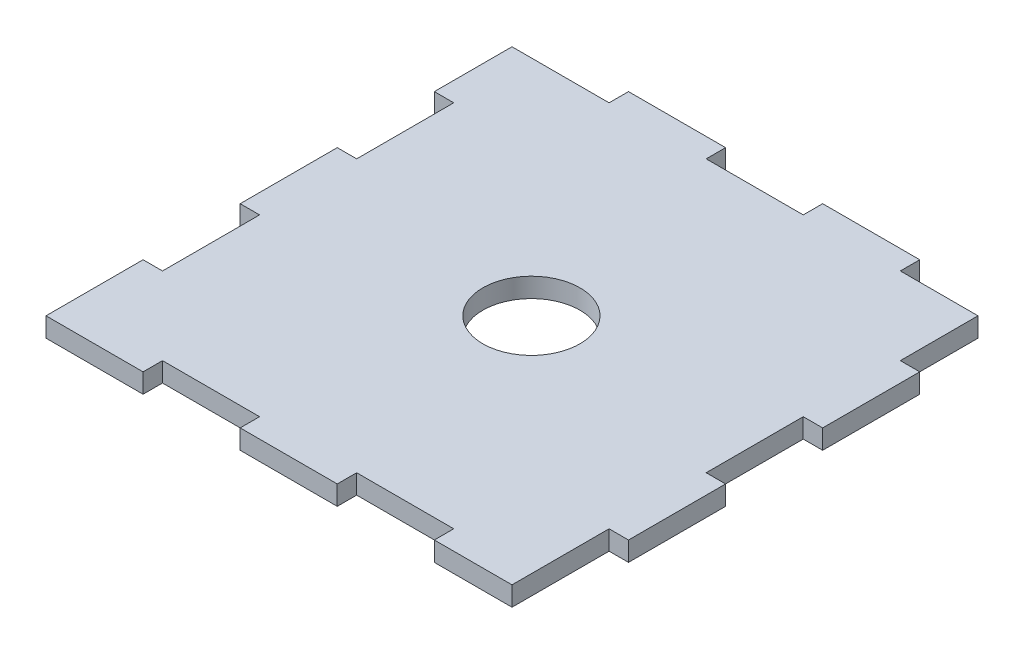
ISO-10303-21;
HEADER;
FILE_DESCRIPTION(('STEP AP214'),'2;1');
FILE_NAME('part.step','',(''),(''),'','','');
FILE_SCHEMA(('AUTOMOTIVE_DESIGN { 1 0 10303 214 1 1 1 1 }'));
ENDSEC;
DATA;
#1=APPLICATION_CONTEXT('core data for automotive mechanical design processes');
#2=APPLICATION_PROTOCOL_DEFINITION('international standard','automotive_design',2000,#1);
#3=PRODUCT_CONTEXT('',#1,'mechanical');
#4=PRODUCT('Part','Part','',(#3));
#5=PRODUCT_RELATED_PRODUCT_CATEGORY('part','',(#4));
#6=PRODUCT_DEFINITION_FORMATION('','',#4);
#7=PRODUCT_DEFINITION_CONTEXT('part definition',#1,'design');
#8=PRODUCT_DEFINITION('design','',#6,#7);
#9=PRODUCT_DEFINITION_SHAPE('','',#8);
#10=(LENGTH_UNIT() NAMED_UNIT(*) SI_UNIT(.MILLI.,.METRE.));
#11=(NAMED_UNIT(*) PLANE_ANGLE_UNIT() SI_UNIT($,.RADIAN.));
#12=(NAMED_UNIT(*) SI_UNIT($,.STERADIAN.) SOLID_ANGLE_UNIT());
#13=UNCERTAINTY_MEASURE_WITH_UNIT(LENGTH_MEASURE(1.E-05),#10,'distance_accuracy_value','');
#14=(GEOMETRIC_REPRESENTATION_CONTEXT(3) GLOBAL_UNCERTAINTY_ASSIGNED_CONTEXT((#13)) GLOBAL_UNIT_ASSIGNED_CONTEXT((#10,
#11,#12)) REPRESENTATION_CONTEXT('',''));
#15=CARTESIAN_POINT('',(0.,0.,0.));
#16=DIRECTION('',(0.,0.,1.));
#17=DIRECTION('',(1.,0.,0.));
#18=AXIS2_PLACEMENT_3D('',#15,#16,#17);
#19=CARTESIAN_POINT('',(0.,4.,0.));
#20=DIRECTION('',(0.,1.,0.));
#21=DIRECTION('',(0.,0.,1.));
#22=AXIS2_PLACEMENT_3D('',#19,#20,#21);
#23=PLANE('',#22);
#24=DIRECTION('',(0.,0.,-1.));
#25=VECTOR('',#24,1.);
#26=CARTESIAN_POINT('',(46.,4.,30.));
#27=LINE('',#26,#25);
#28=CARTESIAN_POINT('',(46.,4.,50.));
#29=VERTEX_POINT('',#28);
#30=CARTESIAN_POINT('',(46.,4.,30.));
#31=VERTEX_POINT('',#30);
#32=EDGE_CURVE('E369',#29,#31,#27,.T.);
#33=ORIENTED_EDGE('',*,*,#32,.T.);
#34=DIRECTION('',(1.,0.,0.));
#35=VECTOR('',#34,1.);
#36=CARTESIAN_POINT('',(50.,4.,30.));
#37=LINE('',#36,#35);
#38=CARTESIAN_POINT('',(50.,4.,30.));
#39=VERTEX_POINT('',#38);
#40=EDGE_CURVE('E177',#31,#39,#37,.T.);
#41=ORIENTED_EDGE('',*,*,#40,.T.);
#42=DIRECTION('',(0.,0.,-1.));
#43=VECTOR('',#42,1.);
#44=CARTESIAN_POINT('',(50.,4.,9.99999999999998));
#45=LINE('',#44,#43);
#46=CARTESIAN_POINT('',(50.,4.,9.99999999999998));
#47=VERTEX_POINT('',#46);
#48=EDGE_CURVE('E468',#39,#47,#45,.T.);
#49=ORIENTED_EDGE('',*,*,#48,.T.);
#50=DIRECTION('',(-1.,0.,0.));
#51=VECTOR('',#50,1.);
#52=CARTESIAN_POINT('',(46.,4.,9.99999999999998));
#53=LINE('',#52,#51);
#54=CARTESIAN_POINT('',(46.,4.,9.99999999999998));
#55=VERTEX_POINT('',#54);
#56=EDGE_CURVE('E487',#47,#55,#53,.T.);
#57=ORIENTED_EDGE('',*,*,#56,.T.);
#58=DIRECTION('',(0.,0.,-1.));
#59=VECTOR('',#58,1.);
#60=CARTESIAN_POINT('',(46.,4.,-10.));
#61=LINE('',#60,#59);
#62=CARTESIAN_POINT('',(46.,4.,-10.));
#63=VERTEX_POINT('',#62);
#64=EDGE_CURVE('E484',#55,#63,#61,.T.);
#65=ORIENTED_EDGE('',*,*,#64,.T.);
#66=DIRECTION('',(1.,0.,0.));
#67=VECTOR('',#66,1.);
#68=CARTESIAN_POINT('',(50.,4.,-10.));
#69=LINE('',#68,#67);
#70=CARTESIAN_POINT('',(50.,4.,-10.));
#71=VERTEX_POINT('',#70);
#72=EDGE_CURVE('E486',#63,#71,#69,.T.);
#73=ORIENTED_EDGE('',*,*,#72,.T.);
#74=DIRECTION('',(0.,0.,-1.));
#75=VECTOR('',#74,1.);
#76=CARTESIAN_POINT('',(50.,4.,-30.));
#77=LINE('',#76,#75);
#78=CARTESIAN_POINT('',(50.,4.,-30.));
#79=VERTEX_POINT('',#78);
#80=EDGE_CURVE('E489',#71,#79,#77,.T.);
#81=ORIENTED_EDGE('',*,*,#80,.T.);
#82=DIRECTION('',(-1.,0.,0.));
#83=VECTOR('',#82,1.);
#84=CARTESIAN_POINT('',(46.,4.,-30.));
#85=LINE('',#84,#83);
#86=CARTESIAN_POINT('',(46.,4.,-30.));
#87=VERTEX_POINT('',#86);
#88=EDGE_CURVE('E495',#79,#87,#85,.T.);
#89=ORIENTED_EDGE('',*,*,#88,.T.);
#90=DIRECTION('',(0.,0.,-1.));
#91=VECTOR('',#90,1.);
#92=CARTESIAN_POINT('',(46.,4.,-46.));
#93=LINE('',#92,#91);
#94=CARTESIAN_POINT('',(46.,4.,-46.));
#95=VERTEX_POINT('',#94);
#96=EDGE_CURVE('E497',#87,#95,#93,.T.);
#97=ORIENTED_EDGE('',*,*,#96,.T.);
#98=DIRECTION('',(-1.,0.,0.));
#99=VECTOR('',#98,1.);
#100=CARTESIAN_POINT('',(30.,4.,-46.));
#101=LINE('',#100,#99);
#102=CARTESIAN_POINT('',(30.,4.,-46.));
#103=VERTEX_POINT('',#102);
#104=EDGE_CURVE('E499',#95,#103,#101,.T.);
#105=ORIENTED_EDGE('',*,*,#104,.T.);
#106=DIRECTION('',(0.,0.,-1.));
#107=VECTOR('',#106,1.);
#108=CARTESIAN_POINT('',(30.,4.,-50.));
#109=LINE('',#108,#107);
#110=CARTESIAN_POINT('',(30.,4.,-50.));
#111=VERTEX_POINT('',#110);
#112=EDGE_CURVE('E501',#103,#111,#109,.T.);
#113=ORIENTED_EDGE('',*,*,#112,.T.);
#114=DIRECTION('',(-1.,0.,0.));
#115=VECTOR('',#114,1.);
#116=CARTESIAN_POINT('',(9.99999999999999,4.,-50.));
#117=LINE('',#116,#115);
#118=CARTESIAN_POINT('',(9.99999999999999,4.,-50.));
#119=VERTEX_POINT('',#118);
#120=EDGE_CURVE('E503',#111,#119,#117,.T.);
#121=ORIENTED_EDGE('',*,*,#120,.T.);
#122=DIRECTION('',(0.,0.,1.));
#123=VECTOR('',#122,1.);
#124=CARTESIAN_POINT('',(9.99999999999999,4.,-46.0000000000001));
#125=LINE('',#124,#123);
#126=CARTESIAN_POINT('',(9.99999999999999,4.,-46.0000000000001));
#127=VERTEX_POINT('',#126);
#128=EDGE_CURVE('E505',#119,#127,#125,.T.);
#129=ORIENTED_EDGE('',*,*,#128,.T.);
#130=DIRECTION('',(-1.,0.,0.));
#131=VECTOR('',#130,1.);
#132=CARTESIAN_POINT('',(-10.,4.,-46.0000000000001));
#133=LINE('',#132,#131);
#134=CARTESIAN_POINT('',(-10.,4.,-46.0000000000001));
#135=VERTEX_POINT('',#134);
#136=EDGE_CURVE('E507',#127,#135,#133,.T.);
#137=ORIENTED_EDGE('',*,*,#136,.T.);
#138=DIRECTION('',(0.,0.,-1.));
#139=VECTOR('',#138,1.);
#140=CARTESIAN_POINT('',(-10.,4.,-50.));
#141=LINE('',#140,#139);
#142=CARTESIAN_POINT('',(-10.,4.,-50.));
#143=VERTEX_POINT('',#142);
#144=EDGE_CURVE('E509',#135,#143,#141,.T.);
#145=ORIENTED_EDGE('',*,*,#144,.T.);
#146=DIRECTION('',(-1.,0.,0.));
#147=VECTOR('',#146,1.);
#148=CARTESIAN_POINT('',(-30.,4.,-50.));
#149=LINE('',#148,#147);
#150=CARTESIAN_POINT('',(-30.,4.,-50.));
#151=VERTEX_POINT('',#150);
#152=EDGE_CURVE('E511',#143,#151,#149,.T.);
#153=ORIENTED_EDGE('',*,*,#152,.T.);
#154=DIRECTION('',(0.,0.,1.));
#155=VECTOR('',#154,1.);
#156=CARTESIAN_POINT('',(-30.,4.,-46.));
#157=LINE('',#156,#155);
#158=CARTESIAN_POINT('',(-30.,4.,-46.));
#159=VERTEX_POINT('',#158);
#160=EDGE_CURVE('E513',#151,#159,#157,.T.);
#161=ORIENTED_EDGE('',*,*,#160,.T.);
#162=DIRECTION('',(-1.,0.,0.));
#163=VECTOR('',#162,1.);
#164=CARTESIAN_POINT('',(-50.,4.,-46.));
#165=LINE('',#164,#163);
#166=CARTESIAN_POINT('',(-50.,4.,-46.));
#167=VERTEX_POINT('',#166);
#168=EDGE_CURVE('E515',#159,#167,#165,.T.);
#169=ORIENTED_EDGE('',*,*,#168,.T.);
#170=DIRECTION('',(0.,0.,1.));
#171=VECTOR('',#170,1.);
#172=CARTESIAN_POINT('',(-50.,4.,-46.));
#173=LINE('',#172,#171);
#174=CARTESIAN_POINT('',(-50.,4.,-30.));
#175=VERTEX_POINT('',#174);
#176=EDGE_CURVE('E517',#167,#175,#173,.T.);
#177=ORIENTED_EDGE('',*,*,#176,.T.);
#178=DIRECTION('',(1.,0.,0.));
#179=VECTOR('',#178,1.);
#180=CARTESIAN_POINT('',(-50.,4.,-30.));
#181=LINE('',#180,#179);
#182=CARTESIAN_POINT('',(-46.,4.,-30.));
#183=VERTEX_POINT('',#182);
#184=EDGE_CURVE('E519',#175,#183,#181,.T.);
#185=ORIENTED_EDGE('',*,*,#184,.T.);
#186=DIRECTION('',(0.,0.,1.));
#187=VECTOR('',#186,1.);
#188=CARTESIAN_POINT('',(-46.,4.,-30.));
#189=LINE('',#188,#187);
#190=CARTESIAN_POINT('',(-46.,4.,-10.));
#191=VERTEX_POINT('',#190);
#192=EDGE_CURVE('E521',#183,#191,#189,.T.);
#193=ORIENTED_EDGE('',*,*,#192,.T.);
#194=DIRECTION('',(-1.,0.,0.));
#195=VECTOR('',#194,1.);
#196=CARTESIAN_POINT('',(-46.,4.,-10.));
#197=LINE('',#196,#195);
#198=CARTESIAN_POINT('',(-50.,4.,-10.));
#199=VERTEX_POINT('',#198);
#200=EDGE_CURVE('E523',#191,#199,#197,.T.);
#201=ORIENTED_EDGE('',*,*,#200,.T.);
#202=DIRECTION('',(0.,0.,1.));
#203=VECTOR('',#202,1.);
#204=CARTESIAN_POINT('',(-50.,4.,-10.));
#205=LINE('',#204,#203);
#206=CARTESIAN_POINT('',(-50.,4.,9.99999999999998));
#207=VERTEX_POINT('',#206);
#208=EDGE_CURVE('E525',#199,#207,#205,.T.);
#209=ORIENTED_EDGE('',*,*,#208,.T.);
#210=DIRECTION('',(1.,0.,0.));
#211=VECTOR('',#210,1.);
#212=CARTESIAN_POINT('',(-50.,4.,9.99999999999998));
#213=LINE('',#212,#211);
#214=CARTESIAN_POINT('',(-46.,4.,9.99999999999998));
#215=VERTEX_POINT('',#214);
#216=EDGE_CURVE('E527',#207,#215,#213,.T.);
#217=ORIENTED_EDGE('',*,*,#216,.T.);
#218=DIRECTION('',(0.,0.,1.));
#219=VECTOR('',#218,1.);
#220=CARTESIAN_POINT('',(-46.,4.,9.99999999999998));
#221=LINE('',#220,#219);
#222=CARTESIAN_POINT('',(-46.,4.,30.));
#223=VERTEX_POINT('',#222);
#224=EDGE_CURVE('E529',#215,#223,#221,.T.);
#225=ORIENTED_EDGE('',*,*,#224,.T.);
#226=DIRECTION('',(-1.,0.,0.));
#227=VECTOR('',#226,1.);
#228=CARTESIAN_POINT('',(-46.,4.,30.));
#229=LINE('',#228,#227);
#230=CARTESIAN_POINT('',(-50.,4.,30.));
#231=VERTEX_POINT('',#230);
#232=EDGE_CURVE('E531',#223,#231,#229,.T.);
#233=ORIENTED_EDGE('',*,*,#232,.T.);
#234=DIRECTION('',(0.,0.,1.));
#235=VECTOR('',#234,1.);
#236=CARTESIAN_POINT('',(-50.,4.,30.));
#237=LINE('',#236,#235);
#238=CARTESIAN_POINT('',(-50.,4.,50.));
#239=VERTEX_POINT('',#238);
#240=EDGE_CURVE('E533',#231,#239,#237,.T.);
#241=ORIENTED_EDGE('',*,*,#240,.T.);
#242=DIRECTION('',(1.,0.,0.));
#243=VECTOR('',#242,1.);
#244=CARTESIAN_POINT('',(-50.,4.,50.));
#245=LINE('',#244,#243);
#246=CARTESIAN_POINT('',(-30.,4.,50.));
#247=VERTEX_POINT('',#246);
#248=EDGE_CURVE('E535',#239,#247,#245,.T.);
#249=ORIENTED_EDGE('',*,*,#248,.T.);
#250=DIRECTION('',(0.,0.,-1.));
#251=VECTOR('',#250,1.);
#252=CARTESIAN_POINT('',(-30.,4.,46.));
#253=LINE('',#252,#251);
#254=CARTESIAN_POINT('',(-30.,4.,46.));
#255=VERTEX_POINT('',#254);
#256=EDGE_CURVE('E537',#247,#255,#253,.T.);
#257=ORIENTED_EDGE('',*,*,#256,.T.);
#258=DIRECTION('',(1.,0.,0.));
#259=VECTOR('',#258,1.);
#260=CARTESIAN_POINT('',(-10.,4.,46.));
#261=LINE('',#260,#259);
#262=CARTESIAN_POINT('',(-10.,4.,46.));
#263=VERTEX_POINT('',#262);
#264=EDGE_CURVE('E539',#255,#263,#261,.T.);
#265=ORIENTED_EDGE('',*,*,#264,.T.);
#266=DIRECTION('',(0.,0.,1.));
#267=VECTOR('',#266,1.);
#268=CARTESIAN_POINT('',(-10.,4.,46.));
#269=LINE('',#268,#267);
#270=CARTESIAN_POINT('',(-10.,4.,50.));
#271=VERTEX_POINT('',#270);
#272=EDGE_CURVE('E541',#263,#271,#269,.T.);
#273=ORIENTED_EDGE('',*,*,#272,.T.);
#274=DIRECTION('',(1.,0.,0.));
#275=VECTOR('',#274,1.);
#276=CARTESIAN_POINT('',(-10.,4.,50.));
#277=LINE('',#276,#275);
#278=CARTESIAN_POINT('',(9.99999999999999,4.,50.));
#279=VERTEX_POINT('',#278);
#280=EDGE_CURVE('E543',#271,#279,#277,.T.);
#281=ORIENTED_EDGE('',*,*,#280,.T.);
#282=DIRECTION('',(0.,0.,-1.));
#283=VECTOR('',#282,1.);
#284=CARTESIAN_POINT('',(9.99999999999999,4.,50.));
#285=LINE('',#284,#283);
#286=CARTESIAN_POINT('',(9.99999999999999,4.,46.));
#287=VERTEX_POINT('',#286);
#288=EDGE_CURVE('E280',#279,#287,#285,.T.);
#289=ORIENTED_EDGE('',*,*,#288,.T.);
#290=DIRECTION('',(1.,0.,0.));
#291=VECTOR('',#290,1.);
#292=CARTESIAN_POINT('',(9.99999999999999,4.,46.));
#293=LINE('',#292,#291);
#294=CARTESIAN_POINT('',(30.,4.,46.));
#295=VERTEX_POINT('',#294);
#296=EDGE_CURVE('E274',#287,#295,#293,.T.);
#297=ORIENTED_EDGE('',*,*,#296,.T.);
#298=DIRECTION('',(0.,0.,1.));
#299=VECTOR('',#298,1.);
#300=CARTESIAN_POINT('',(30.,4.,46.));
#301=LINE('',#300,#299);
#302=CARTESIAN_POINT('',(30.,4.,50.));
#303=VERTEX_POINT('',#302);
#304=EDGE_CURVE('E278',#295,#303,#301,.T.);
#305=ORIENTED_EDGE('',*,*,#304,.T.);
#306=DIRECTION('',(1.,0.,0.));
#307=VECTOR('',#306,1.);
#308=CARTESIAN_POINT('',(30.,4.,50.));
#309=LINE('',#308,#307);
#310=EDGE_CURVE('E50',#303,#29,#309,.T.);
#311=ORIENTED_EDGE('',*,*,#310,.T.);
#312=EDGE_LOOP('',(#33,#41,#49,#57,#65,#73,#81,#89,#97,#105,#113,#121,#129,#137,#145,#153,#161,
#169,#177,#185,#193,#201,#209,#217,#225,#233,#241,#249,#257,#265,#273,#281,#289,#297,#305,#311));
#313=FACE_BOUND('',#312,.T.);
#314=CARTESIAN_POINT('',(0.,4.,0.));
#315=DIRECTION('',(0.,1.,0.));
#316=DIRECTION('',(0.,0.,1.));
#317=AXIS2_PLACEMENT_3D('',#314,#315,#316);
#318=CIRCLE('',#317,10.);
#319=CARTESIAN_POINT('',(0.,4.,10.));
#320=VERTEX_POINT('',#319);
#321=EDGE_CURVE('E302',#320,#320,#318,.T.);
#322=ORIENTED_EDGE('',*,*,#321,.F.);
#323=EDGE_LOOP('',(#322));
#324=FACE_BOUND('',#323,.T.);
#325=ADVANCED_FACE('F33',(#313,#324),#23,.T.);
#326=CARTESIAN_POINT('',(0.,0.,0.));
#327=DIRECTION('',(0.,1.,0.));
#328=DIRECTION('',(0.,0.,1.));
#329=AXIS2_PLACEMENT_3D('',#326,#327,#328);
#330=PLANE('',#329);
#331=DIRECTION('',(0.,0.,-1.));
#332=VECTOR('',#331,1.);
#333=CARTESIAN_POINT('',(46.,0.,30.));
#334=LINE('',#333,#332);
#335=CARTESIAN_POINT('',(46.,0.,50.));
#336=VERTEX_POINT('',#335);
#337=CARTESIAN_POINT('',(46.,0.,30.));
#338=VERTEX_POINT('',#337);
#339=EDGE_CURVE('E298',#336,#338,#334,.T.);
#340=ORIENTED_EDGE('',*,*,#339,.F.);
#341=DIRECTION('',(1.,0.,0.));
#342=VECTOR('',#341,1.);
#343=CARTESIAN_POINT('',(30.,0.,50.));
#344=LINE('',#343,#342);
#345=CARTESIAN_POINT('',(30.,0.,50.));
#346=VERTEX_POINT('',#345);
#347=EDGE_CURVE('E169',#346,#336,#344,.T.);
#348=ORIENTED_EDGE('',*,*,#347,.F.);
#349=DIRECTION('',(0.,0.,1.));
#350=VECTOR('',#349,1.);
#351=CARTESIAN_POINT('',(30.,0.,46.));
#352=LINE('',#351,#350);
#353=CARTESIAN_POINT('',(30.,0.,46.));
#354=VERTEX_POINT('',#353);
#355=EDGE_CURVE('E163',#354,#346,#352,.T.);
#356=ORIENTED_EDGE('',*,*,#355,.F.);
#357=DIRECTION('',(1.,0.,0.));
#358=VECTOR('',#357,1.);
#359=CARTESIAN_POINT('',(9.99999999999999,0.,46.));
#360=LINE('',#359,#358);
#361=CARTESIAN_POINT('',(9.99999999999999,0.,46.));
#362=VERTEX_POINT('',#361);
#363=EDGE_CURVE('E288',#362,#354,#360,.T.);
#364=ORIENTED_EDGE('',*,*,#363,.F.);
#365=DIRECTION('',(0.,0.,-1.));
#366=VECTOR('',#365,1.);
#367=CARTESIAN_POINT('',(9.99999999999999,0.,50.));
#368=LINE('',#367,#366);
#369=CARTESIAN_POINT('',(9.99999999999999,0.,50.));
#370=VERTEX_POINT('',#369);
#371=EDGE_CURVE('E364',#370,#362,#368,.T.);
#372=ORIENTED_EDGE('',*,*,#371,.F.);
#373=DIRECTION('',(1.,0.,0.));
#374=VECTOR('',#373,1.);
#375=CARTESIAN_POINT('',(-10.,0.,50.));
#376=LINE('',#375,#374);
#377=CARTESIAN_POINT('',(-10.,0.,50.));
#378=VERTEX_POINT('',#377);
#379=EDGE_CURVE('E362',#378,#370,#376,.T.);
#380=ORIENTED_EDGE('',*,*,#379,.F.);
#381=DIRECTION('',(0.,0.,1.));
#382=VECTOR('',#381,1.);
#383=CARTESIAN_POINT('',(-10.,0.,46.));
#384=LINE('',#383,#382);
#385=CARTESIAN_POINT('',(-10.,0.,46.));
#386=VERTEX_POINT('',#385);
#387=EDGE_CURVE('E360',#386,#378,#384,.T.);
#388=ORIENTED_EDGE('',*,*,#387,.F.);
#389=DIRECTION('',(1.,0.,0.));
#390=VECTOR('',#389,1.);
#391=CARTESIAN_POINT('',(-10.,0.,46.));
#392=LINE('',#391,#390);
#393=CARTESIAN_POINT('',(-30.,0.,46.));
#394=VERTEX_POINT('',#393);
#395=EDGE_CURVE('E358',#394,#386,#392,.T.);
#396=ORIENTED_EDGE('',*,*,#395,.F.);
#397=DIRECTION('',(0.,0.,-1.));
#398=VECTOR('',#397,1.);
#399=CARTESIAN_POINT('',(-30.,0.,46.));
#400=LINE('',#399,#398);
#401=CARTESIAN_POINT('',(-30.,0.,50.));
#402=VERTEX_POINT('',#401);
#403=EDGE_CURVE('E356',#402,#394,#400,.T.);
#404=ORIENTED_EDGE('',*,*,#403,.F.);
#405=DIRECTION('',(1.,0.,0.));
#406=VECTOR('',#405,1.);
#407=CARTESIAN_POINT('',(-50.,0.,50.));
#408=LINE('',#407,#406);
#409=CARTESIAN_POINT('',(-50.,0.,50.));
#410=VERTEX_POINT('',#409);
#411=EDGE_CURVE('E354',#410,#402,#408,.T.);
#412=ORIENTED_EDGE('',*,*,#411,.F.);
#413=DIRECTION('',(0.,0.,1.));
#414=VECTOR('',#413,1.);
#415=CARTESIAN_POINT('',(-50.,0.,30.));
#416=LINE('',#415,#414);
#417=CARTESIAN_POINT('',(-50.,0.,30.));
#418=VERTEX_POINT('',#417);
#419=EDGE_CURVE('E352',#418,#410,#416,.T.);
#420=ORIENTED_EDGE('',*,*,#419,.F.);
#421=DIRECTION('',(-1.,0.,0.));
#422=VECTOR('',#421,1.);
#423=CARTESIAN_POINT('',(-46.,0.,30.));
#424=LINE('',#423,#422);
#425=CARTESIAN_POINT('',(-46.,0.,30.));
#426=VERTEX_POINT('',#425);
#427=EDGE_CURVE('E350',#426,#418,#424,.T.);
#428=ORIENTED_EDGE('',*,*,#427,.F.);
#429=DIRECTION('',(0.,0.,1.));
#430=VECTOR('',#429,1.);
#431=CARTESIAN_POINT('',(-46.,0.,9.99999999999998));
#432=LINE('',#431,#430);
#433=CARTESIAN_POINT('',(-46.,0.,9.99999999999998));
#434=VERTEX_POINT('',#433);
#435=EDGE_CURVE('E348',#434,#426,#432,.T.);
#436=ORIENTED_EDGE('',*,*,#435,.F.);
#437=DIRECTION('',(1.,0.,0.));
#438=VECTOR('',#437,1.);
#439=CARTESIAN_POINT('',(-50.,0.,9.99999999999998));
#440=LINE('',#439,#438);
#441=CARTESIAN_POINT('',(-50.,0.,9.99999999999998));
#442=VERTEX_POINT('',#441);
#443=EDGE_CURVE('E346',#442,#434,#440,.T.);
#444=ORIENTED_EDGE('',*,*,#443,.F.);
#445=DIRECTION('',(0.,0.,1.));
#446=VECTOR('',#445,1.);
#447=CARTESIAN_POINT('',(-50.,0.,-10.));
#448=LINE('',#447,#446);
#449=CARTESIAN_POINT('',(-50.,0.,-10.));
#450=VERTEX_POINT('',#449);
#451=EDGE_CURVE('E344',#450,#442,#448,.T.);
#452=ORIENTED_EDGE('',*,*,#451,.F.);
#453=DIRECTION('',(-1.,0.,0.));
#454=VECTOR('',#453,1.);
#455=CARTESIAN_POINT('',(-46.,0.,-10.));
#456=LINE('',#455,#454);
#457=CARTESIAN_POINT('',(-46.,0.,-10.));
#458=VERTEX_POINT('',#457);
#459=EDGE_CURVE('E342',#458,#450,#456,.T.);
#460=ORIENTED_EDGE('',*,*,#459,.F.);
#461=DIRECTION('',(0.,0.,1.));
#462=VECTOR('',#461,1.);
#463=CARTESIAN_POINT('',(-46.,0.,-30.));
#464=LINE('',#463,#462);
#465=CARTESIAN_POINT('',(-46.,0.,-30.));
#466=VERTEX_POINT('',#465);
#467=EDGE_CURVE('E340',#466,#458,#464,.T.);
#468=ORIENTED_EDGE('',*,*,#467,.F.);
#469=DIRECTION('',(1.,0.,0.));
#470=VECTOR('',#469,1.);
#471=CARTESIAN_POINT('',(-50.,0.,-30.));
#472=LINE('',#471,#470);
#473=CARTESIAN_POINT('',(-50.,0.,-30.));
#474=VERTEX_POINT('',#473);
#475=EDGE_CURVE('E338',#474,#466,#472,.T.);
#476=ORIENTED_EDGE('',*,*,#475,.F.);
#477=DIRECTION('',(0.,0.,1.));
#478=VECTOR('',#477,1.);
#479=CARTESIAN_POINT('',(-50.,0.,-46.));
#480=LINE('',#479,#478);
#481=CARTESIAN_POINT('',(-50.,0.,-46.));
#482=VERTEX_POINT('',#481);
#483=EDGE_CURVE('E336',#482,#474,#480,.T.);
#484=ORIENTED_EDGE('',*,*,#483,.F.);
#485=DIRECTION('',(-1.,0.,0.));
#486=VECTOR('',#485,1.);
#487=CARTESIAN_POINT('',(-50.,0.,-46.));
#488=LINE('',#487,#486);
#489=CARTESIAN_POINT('',(-30.,0.,-46.));
#490=VERTEX_POINT('',#489);
#491=EDGE_CURVE('E334',#490,#482,#488,.T.);
#492=ORIENTED_EDGE('',*,*,#491,.F.);
#493=DIRECTION('',(0.,0.,1.));
#494=VECTOR('',#493,1.);
#495=CARTESIAN_POINT('',(-30.,0.,-46.));
#496=LINE('',#495,#494);
#497=CARTESIAN_POINT('',(-30.,0.,-50.));
#498=VERTEX_POINT('',#497);
#499=EDGE_CURVE('E332',#498,#490,#496,.T.);
#500=ORIENTED_EDGE('',*,*,#499,.F.);
#501=DIRECTION('',(-1.,0.,0.));
#502=VECTOR('',#501,1.);
#503=CARTESIAN_POINT('',(-30.,0.,-50.));
#504=LINE('',#503,#502);
#505=CARTESIAN_POINT('',(-10.,0.,-50.));
#506=VERTEX_POINT('',#505);
#507=EDGE_CURVE('E330',#506,#498,#504,.T.);
#508=ORIENTED_EDGE('',*,*,#507,.F.);
#509=DIRECTION('',(0.,0.,-1.));
#510=VECTOR('',#509,1.);
#511=CARTESIAN_POINT('',(-10.,0.,-50.));
#512=LINE('',#511,#510);
#513=CARTESIAN_POINT('',(-10.,0.,-46.0000000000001));
#514=VERTEX_POINT('',#513);
#515=EDGE_CURVE('E328',#514,#506,#512,.T.);
#516=ORIENTED_EDGE('',*,*,#515,.F.);
#517=DIRECTION('',(-1.,0.,0.));
#518=VECTOR('',#517,1.);
#519=CARTESIAN_POINT('',(-10.,0.,-46.0000000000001));
#520=LINE('',#519,#518);
#521=CARTESIAN_POINT('',(9.99999999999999,0.,-46.0000000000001));
#522=VERTEX_POINT('',#521);
#523=EDGE_CURVE('E326',#522,#514,#520,.T.);
#524=ORIENTED_EDGE('',*,*,#523,.F.);
#525=DIRECTION('',(0.,0.,1.));
#526=VECTOR('',#525,1.);
#527=CARTESIAN_POINT('',(9.99999999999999,0.,-46.0000000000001));
#528=LINE('',#527,#526);
#529=CARTESIAN_POINT('',(9.99999999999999,0.,-50.));
#530=VERTEX_POINT('',#529);
#531=EDGE_CURVE('E324',#530,#522,#528,.T.);
#532=ORIENTED_EDGE('',*,*,#531,.F.);
#533=DIRECTION('',(-1.,0.,0.));
#534=VECTOR('',#533,1.);
#535=CARTESIAN_POINT('',(9.99999999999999,0.,-50.));
#536=LINE('',#535,#534);
#537=CARTESIAN_POINT('',(30.,0.,-50.));
#538=VERTEX_POINT('',#537);
#539=EDGE_CURVE('E322',#538,#530,#536,.T.);
#540=ORIENTED_EDGE('',*,*,#539,.F.);
#541=DIRECTION('',(0.,0.,-1.));
#542=VECTOR('',#541,1.);
#543=CARTESIAN_POINT('',(30.,0.,-50.));
#544=LINE('',#543,#542);
#545=CARTESIAN_POINT('',(30.,0.,-46.));
#546=VERTEX_POINT('',#545);
#547=EDGE_CURVE('E320',#546,#538,#544,.T.);
#548=ORIENTED_EDGE('',*,*,#547,.F.);
#549=DIRECTION('',(-1.,0.,0.));
#550=VECTOR('',#549,1.);
#551=CARTESIAN_POINT('',(30.,0.,-46.));
#552=LINE('',#551,#550);
#553=CARTESIAN_POINT('',(46.,0.,-46.));
#554=VERTEX_POINT('',#553);
#555=EDGE_CURVE('E318',#554,#546,#552,.T.);
#556=ORIENTED_EDGE('',*,*,#555,.F.);
#557=DIRECTION('',(0.,0.,-1.));
#558=VECTOR('',#557,1.);
#559=CARTESIAN_POINT('',(46.,0.,-46.));
#560=LINE('',#559,#558);
#561=CARTESIAN_POINT('',(46.,0.,-30.));
#562=VERTEX_POINT('',#561);
#563=EDGE_CURVE('E316',#562,#554,#560,.T.);
#564=ORIENTED_EDGE('',*,*,#563,.F.);
#565=DIRECTION('',(-1.,0.,0.));
#566=VECTOR('',#565,1.);
#567=CARTESIAN_POINT('',(46.,0.,-30.));
#568=LINE('',#567,#566);
#569=CARTESIAN_POINT('',(50.,0.,-30.));
#570=VERTEX_POINT('',#569);
#571=EDGE_CURVE('E314',#570,#562,#568,.T.);
#572=ORIENTED_EDGE('',*,*,#571,.F.);
#573=DIRECTION('',(0.,0.,-1.));
#574=VECTOR('',#573,1.);
#575=CARTESIAN_POINT('',(50.,0.,-30.));
#576=LINE('',#575,#574);
#577=CARTESIAN_POINT('',(50.,0.,-10.));
#578=VERTEX_POINT('',#577);
#579=EDGE_CURVE('E312',#578,#570,#576,.T.);
#580=ORIENTED_EDGE('',*,*,#579,.F.);
#581=DIRECTION('',(1.,0.,0.));
#582=VECTOR('',#581,1.);
#583=CARTESIAN_POINT('',(50.,0.,-10.));
#584=LINE('',#583,#582);
#585=CARTESIAN_POINT('',(46.,0.,-10.));
#586=VERTEX_POINT('',#585);
#587=EDGE_CURVE('E310',#586,#578,#584,.T.);
#588=ORIENTED_EDGE('',*,*,#587,.F.);
#589=DIRECTION('',(0.,0.,-1.));
#590=VECTOR('',#589,1.);
#591=CARTESIAN_POINT('',(46.,0.,-10.));
#592=LINE('',#591,#590);
#593=CARTESIAN_POINT('',(46.,0.,9.99999999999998));
#594=VERTEX_POINT('',#593);
#595=EDGE_CURVE('E308',#594,#586,#592,.T.);
#596=ORIENTED_EDGE('',*,*,#595,.F.);
#597=DIRECTION('',(-1.,0.,0.));
#598=VECTOR('',#597,1.);
#599=CARTESIAN_POINT('',(46.,0.,9.99999999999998));
#600=LINE('',#599,#598);
#601=CARTESIAN_POINT('',(50.,0.,9.99999999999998));
#602=VERTEX_POINT('',#601);
#603=EDGE_CURVE('E306',#602,#594,#600,.T.);
#604=ORIENTED_EDGE('',*,*,#603,.F.);
#605=DIRECTION('',(0.,0.,-1.));
#606=VECTOR('',#605,1.);
#607=CARTESIAN_POINT('',(50.,0.,9.99999999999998));
#608=LINE('',#607,#606);
#609=CARTESIAN_POINT('',(50.,0.,30.));
#610=VERTEX_POINT('',#609);
#611=EDGE_CURVE('E304',#610,#602,#608,.T.);
#612=ORIENTED_EDGE('',*,*,#611,.F.);
#613=DIRECTION('',(1.,0.,0.));
#614=VECTOR('',#613,1.);
#615=CARTESIAN_POINT('',(50.,0.,30.));
#616=LINE('',#615,#614);
#617=EDGE_CURVE('E301',#338,#610,#616,.T.);
#618=ORIENTED_EDGE('',*,*,#617,.F.);
#619=EDGE_LOOP('',(#340,#348,#356,#364,#372,#380,#388,#396,#404,#412,#420,#428,#436,#444,#452,
#460,#468,#476,#484,#492,#500,#508,#516,#524,#532,#540,#548,#556,#564,#572,#580,#588,#596,#604,
#612,#618));
#620=FACE_BOUND('',#619,.T.);
#621=CARTESIAN_POINT('',(0.,0.,0.));
#622=DIRECTION('',(0.,1.,0.));
#623=DIRECTION('',(0.,0.,1.));
#624=AXIS2_PLACEMENT_3D('',#621,#622,#623);
#625=CIRCLE('',#624,10.);
#626=CARTESIAN_POINT('',(0.,0.,10.));
#627=VERTEX_POINT('',#626);
#628=EDGE_CURVE('E1002',#627,#627,#625,.T.);
#629=ORIENTED_EDGE('',*,*,#628,.T.);
#630=EDGE_LOOP('',(#629));
#631=FACE_BOUND('',#630,.T.);
#632=ADVANCED_FACE('F472',(#620,#631),#330,.F.);
#633=CARTESIAN_POINT('',(46.,4.,30.));
#634=DIRECTION('',(-1.,0.,0.));
#635=DIRECTION('',(0.,0.,1.));
#636=AXIS2_PLACEMENT_3D('',#633,#634,#635);
#637=PLANE('',#636);
#638=ORIENTED_EDGE('',*,*,#339,.T.);
#639=DIRECTION('',(0.,-1.,0.));
#640=VECTOR('',#639,1.);
#641=CARTESIAN_POINT('',(46.,4.,30.));
#642=LINE('',#641,#640);
#643=EDGE_CURVE('E11',#31,#338,#642,.T.);
#644=ORIENTED_EDGE('',*,*,#643,.F.);
#645=ORIENTED_EDGE('',*,*,#32,.F.);
#646=DIRECTION('',(0.,-1.,0.));
#647=VECTOR('',#646,1.);
#648=CARTESIAN_POINT('',(46.,4.,50.));
#649=LINE('',#648,#647);
#650=EDGE_CURVE('E294',#29,#336,#649,.T.);
#651=ORIENTED_EDGE('',*,*,#650,.T.);
#652=EDGE_LOOP('',(#638,#644,#645,#651));
#653=FACE_BOUND('',#652,.T.);
#654=ADVANCED_FACE('F35',(#653),#637,.F.);
#655=CARTESIAN_POINT('',(50.,4.,30.));
#656=DIRECTION('',(0.,0.,-1.));
#657=DIRECTION('',(-1.,0.,0.));
#658=AXIS2_PLACEMENT_3D('',#655,#656,#657);
#659=PLANE('',#658);
#660=ORIENTED_EDGE('',*,*,#617,.T.);
#661=DIRECTION('',(0.,-1.,0.));
#662=VECTOR('',#661,1.);
#663=CARTESIAN_POINT('',(50.,4.,30.));
#664=LINE('',#663,#662);
#665=EDGE_CURVE('E42',#39,#610,#664,.T.);
#666=ORIENTED_EDGE('',*,*,#665,.F.);
#667=ORIENTED_EDGE('',*,*,#40,.F.);
#668=ORIENTED_EDGE('',*,*,#643,.T.);
#669=EDGE_LOOP('',(#660,#666,#667,#668));
#670=FACE_BOUND('',#669,.T.);
#671=ADVANCED_FACE('F577',(#670),#659,.F.);
#672=CARTESIAN_POINT('',(50.,4.,9.99999999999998));
#673=DIRECTION('',(-1.,0.,0.));
#674=DIRECTION('',(0.,0.,1.));
#675=AXIS2_PLACEMENT_3D('',#672,#673,#674);
#676=PLANE('',#675);
#677=ORIENTED_EDGE('',*,*,#611,.T.);
#678=DIRECTION('',(0.,-1.,0.));
#679=VECTOR('',#678,1.);
#680=CARTESIAN_POINT('',(50.,4.,9.99999999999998));
#681=LINE('',#680,#679);
#682=EDGE_CURVE('E460',#47,#602,#681,.T.);
#683=ORIENTED_EDGE('',*,*,#682,.F.);
#684=ORIENTED_EDGE('',*,*,#48,.F.);
#685=ORIENTED_EDGE('',*,*,#665,.T.);
#686=EDGE_LOOP('',(#677,#683,#684,#685));
#687=FACE_BOUND('',#686,.T.);
#688=ADVANCED_FACE('F466',(#687),#676,.F.);
#689=CARTESIAN_POINT('',(46.,4.,9.99999999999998));
#690=DIRECTION('',(0.,0.,1.));
#691=DIRECTION('',(1.,0.,0.));
#692=AXIS2_PLACEMENT_3D('',#689,#690,#691);
#693=PLANE('',#692);
#694=ORIENTED_EDGE('',*,*,#603,.T.);
#695=DIRECTION('',(0.,-1.,0.));
#696=VECTOR('',#695,1.);
#697=CARTESIAN_POINT('',(46.,4.,9.99999999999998));
#698=LINE('',#697,#696);
#699=EDGE_CURVE('E457',#55,#594,#698,.T.);
#700=ORIENTED_EDGE('',*,*,#699,.F.);
#701=ORIENTED_EDGE('',*,*,#56,.F.);
#702=ORIENTED_EDGE('',*,*,#682,.T.);
#703=EDGE_LOOP('',(#694,#700,#701,#702));
#704=FACE_BOUND('',#703,.T.);
#705=ADVANCED_FACE('F478',(#704),#693,.F.);
#706=CARTESIAN_POINT('',(46.,4.,-10.));
#707=DIRECTION('',(-1.,0.,0.));
#708=DIRECTION('',(0.,0.,1.));
#709=AXIS2_PLACEMENT_3D('',#706,#707,#708);
#710=PLANE('',#709);
#711=ORIENTED_EDGE('',*,*,#595,.T.);
#712=DIRECTION('',(0.,-1.,0.));
#713=VECTOR('',#712,1.);
#714=CARTESIAN_POINT('',(46.,4.,-10.));
#715=LINE('',#714,#713);
#716=EDGE_CURVE('E454',#63,#586,#715,.T.);
#717=ORIENTED_EDGE('',*,*,#716,.F.);
#718=ORIENTED_EDGE('',*,*,#64,.F.);
#719=ORIENTED_EDGE('',*,*,#699,.T.);
#720=EDGE_LOOP('',(#711,#717,#718,#719));
#721=FACE_BOUND('',#720,.T.);
#722=ADVANCED_FACE('F482',(#721),#710,.F.);
#723=CARTESIAN_POINT('',(50.,4.,-10.));
#724=DIRECTION('',(0.,0.,-1.));
#725=DIRECTION('',(-1.,0.,0.));
#726=AXIS2_PLACEMENT_3D('',#723,#724,#725);
#727=PLANE('',#726);
#728=ORIENTED_EDGE('',*,*,#587,.T.);
#729=DIRECTION('',(0.,-1.,0.));
#730=VECTOR('',#729,1.);
#731=CARTESIAN_POINT('',(50.,4.,-10.));
#732=LINE('',#731,#730);
#733=EDGE_CURVE('E451',#71,#578,#732,.T.);
#734=ORIENTED_EDGE('',*,*,#733,.F.);
#735=ORIENTED_EDGE('',*,*,#72,.F.);
#736=ORIENTED_EDGE('',*,*,#716,.T.);
#737=EDGE_LOOP('',(#728,#734,#735,#736));
#738=FACE_BOUND('',#737,.T.);
#739=ADVANCED_FACE('F590',(#738),#727,.F.);
#740=CARTESIAN_POINT('',(50.,4.,-30.));
#741=DIRECTION('',(-1.,0.,0.));
#742=DIRECTION('',(0.,0.,1.));
#743=AXIS2_PLACEMENT_3D('',#740,#741,#742);
#744=PLANE('',#743);
#745=ORIENTED_EDGE('',*,*,#579,.T.);
#746=DIRECTION('',(0.,-1.,0.));
#747=VECTOR('',#746,1.);
#748=CARTESIAN_POINT('',(50.,4.,-30.));
#749=LINE('',#748,#747);
#750=EDGE_CURVE('E448',#79,#570,#749,.T.);
#751=ORIENTED_EDGE('',*,*,#750,.F.);
#752=ORIENTED_EDGE('',*,*,#80,.F.);
#753=ORIENTED_EDGE('',*,*,#733,.T.);
#754=EDGE_LOOP('',(#745,#751,#752,#753));
#755=FACE_BOUND('',#754,.T.);
#756=ADVANCED_FACE('F593',(#755),#744,.F.);
#757=CARTESIAN_POINT('',(46.,4.,-30.));
#758=DIRECTION('',(0.,0.,1.));
#759=DIRECTION('',(1.,0.,0.));
#760=AXIS2_PLACEMENT_3D('',#757,#758,#759);
#761=PLANE('',#760);
#762=ORIENTED_EDGE('',*,*,#571,.T.);
#763=DIRECTION('',(0.,-1.,0.));
#764=VECTOR('',#763,1.);
#765=CARTESIAN_POINT('',(46.,4.,-30.));
#766=LINE('',#765,#764);
#767=EDGE_CURVE('E445',#87,#562,#766,.T.);
#768=ORIENTED_EDGE('',*,*,#767,.F.);
#769=ORIENTED_EDGE('',*,*,#88,.F.);
#770=ORIENTED_EDGE('',*,*,#750,.T.);
#771=EDGE_LOOP('',(#762,#768,#769,#770));
#772=FACE_BOUND('',#771,.T.);
#773=ADVANCED_FACE('F597',(#772),#761,.F.);
#774=CARTESIAN_POINT('',(46.,4.,-46.));
#775=DIRECTION('',(-1.,0.,0.));
#776=DIRECTION('',(0.,0.,1.));
#777=AXIS2_PLACEMENT_3D('',#774,#775,#776);
#778=PLANE('',#777);
#779=ORIENTED_EDGE('',*,*,#563,.T.);
#780=DIRECTION('',(0.,-1.,0.));
#781=VECTOR('',#780,1.);
#782=CARTESIAN_POINT('',(46.,4.,-46.));
#783=LINE('',#782,#781);
#784=EDGE_CURVE('E442',#95,#554,#783,.T.);
#785=ORIENTED_EDGE('',*,*,#784,.F.);
#786=ORIENTED_EDGE('',*,*,#96,.F.);
#787=ORIENTED_EDGE('',*,*,#767,.T.);
#788=EDGE_LOOP('',(#779,#785,#786,#787));
#789=FACE_BOUND('',#788,.T.);
#790=ADVANCED_FACE('F601',(#789),#778,.F.);
#791=CARTESIAN_POINT('',(30.,4.,-46.));
#792=DIRECTION('',(0.,0.,1.));
#793=DIRECTION('',(1.,0.,0.));
#794=AXIS2_PLACEMENT_3D('',#791,#792,#793);
#795=PLANE('',#794);
#796=ORIENTED_EDGE('',*,*,#555,.T.);
#797=DIRECTION('',(0.,-1.,0.));
#798=VECTOR('',#797,1.);
#799=CARTESIAN_POINT('',(30.,4.,-46.));
#800=LINE('',#799,#798);
#801=EDGE_CURVE('E439',#103,#546,#800,.T.);
#802=ORIENTED_EDGE('',*,*,#801,.F.);
#803=ORIENTED_EDGE('',*,*,#104,.F.);
#804=ORIENTED_EDGE('',*,*,#784,.T.);
#805=EDGE_LOOP('',(#796,#802,#803,#804));
#806=FACE_BOUND('',#805,.T.);
#807=ADVANCED_FACE('F605',(#806),#795,.F.);
#808=CARTESIAN_POINT('',(30.,4.,-50.));
#809=DIRECTION('',(-1.,0.,0.));
#810=DIRECTION('',(0.,0.,1.));
#811=AXIS2_PLACEMENT_3D('',#808,#809,#810);
#812=PLANE('',#811);
#813=ORIENTED_EDGE('',*,*,#547,.T.);
#814=DIRECTION('',(0.,-1.,0.));
#815=VECTOR('',#814,1.);
#816=CARTESIAN_POINT('',(30.,4.,-50.));
#817=LINE('',#816,#815);
#818=EDGE_CURVE('E436',#111,#538,#817,.T.);
#819=ORIENTED_EDGE('',*,*,#818,.F.);
#820=ORIENTED_EDGE('',*,*,#112,.F.);
#821=ORIENTED_EDGE('',*,*,#801,.T.);
#822=EDGE_LOOP('',(#813,#819,#820,#821));
#823=FACE_BOUND('',#822,.T.);
#824=ADVANCED_FACE('F609',(#823),#812,.F.);
#825=CARTESIAN_POINT('',(9.99999999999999,4.,-50.));
#826=DIRECTION('',(0.,0.,1.));
#827=DIRECTION('',(1.,0.,0.));
#828=AXIS2_PLACEMENT_3D('',#825,#826,#827);
#829=PLANE('',#828);
#830=ORIENTED_EDGE('',*,*,#539,.T.);
#831=DIRECTION('',(0.,-1.,0.));
#832=VECTOR('',#831,1.);
#833=CARTESIAN_POINT('',(9.99999999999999,4.,-50.));
#834=LINE('',#833,#832);
#835=EDGE_CURVE('E433',#119,#530,#834,.T.);
#836=ORIENTED_EDGE('',*,*,#835,.F.);
#837=ORIENTED_EDGE('',*,*,#120,.F.);
#838=ORIENTED_EDGE('',*,*,#818,.T.);
#839=EDGE_LOOP('',(#830,#836,#837,#838));
#840=FACE_BOUND('',#839,.T.);
#841=ADVANCED_FACE('F613',(#840),#829,.F.);
#842=CARTESIAN_POINT('',(9.99999999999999,4.,-46.0000000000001));
#843=DIRECTION('',(1.,0.,0.));
#844=DIRECTION('',(0.,0.,-1.));
#845=AXIS2_PLACEMENT_3D('',#842,#843,#844);
#846=PLANE('',#845);
#847=ORIENTED_EDGE('',*,*,#531,.T.);
#848=DIRECTION('',(0.,-1.,0.));
#849=VECTOR('',#848,1.);
#850=CARTESIAN_POINT('',(9.99999999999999,4.,-46.0000000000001));
#851=LINE('',#850,#849);
#852=EDGE_CURVE('E430',#127,#522,#851,.T.);
#853=ORIENTED_EDGE('',*,*,#852,.F.);
#854=ORIENTED_EDGE('',*,*,#128,.F.);
#855=ORIENTED_EDGE('',*,*,#835,.T.);
#856=EDGE_LOOP('',(#847,#853,#854,#855));
#857=FACE_BOUND('',#856,.T.);
#858=ADVANCED_FACE('F617',(#857),#846,.F.);
#859=CARTESIAN_POINT('',(-10.,4.,-46.0000000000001));
#860=DIRECTION('',(0.,0.,1.));
#861=DIRECTION('',(1.,0.,0.));
#862=AXIS2_PLACEMENT_3D('',#859,#860,#861);
#863=PLANE('',#862);
#864=ORIENTED_EDGE('',*,*,#523,.T.);
#865=DIRECTION('',(0.,-1.,0.));
#866=VECTOR('',#865,1.);
#867=CARTESIAN_POINT('',(-10.,4.,-46.0000000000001));
#868=LINE('',#867,#866);
#869=EDGE_CURVE('E427',#135,#514,#868,.T.);
#870=ORIENTED_EDGE('',*,*,#869,.F.);
#871=ORIENTED_EDGE('',*,*,#136,.F.);
#872=ORIENTED_EDGE('',*,*,#852,.T.);
#873=EDGE_LOOP('',(#864,#870,#871,#872));
#874=FACE_BOUND('',#873,.T.);
#875=ADVANCED_FACE('F621',(#874),#863,.F.);
#876=CARTESIAN_POINT('',(-10.,4.,-50.));
#877=DIRECTION('',(-1.,0.,0.));
#878=DIRECTION('',(0.,0.,1.));
#879=AXIS2_PLACEMENT_3D('',#876,#877,#878);
#880=PLANE('',#879);
#881=ORIENTED_EDGE('',*,*,#515,.T.);
#882=DIRECTION('',(0.,-1.,0.));
#883=VECTOR('',#882,1.);
#884=CARTESIAN_POINT('',(-10.,4.,-50.));
#885=LINE('',#884,#883);
#886=EDGE_CURVE('E424',#143,#506,#885,.T.);
#887=ORIENTED_EDGE('',*,*,#886,.F.);
#888=ORIENTED_EDGE('',*,*,#144,.F.);
#889=ORIENTED_EDGE('',*,*,#869,.T.);
#890=EDGE_LOOP('',(#881,#887,#888,#889));
#891=FACE_BOUND('',#890,.T.);
#892=ADVANCED_FACE('F625',(#891),#880,.F.);
#893=CARTESIAN_POINT('',(-30.,4.,-50.));
#894=DIRECTION('',(0.,0.,1.));
#895=DIRECTION('',(1.,0.,0.));
#896=AXIS2_PLACEMENT_3D('',#893,#894,#895);
#897=PLANE('',#896);
#898=ORIENTED_EDGE('',*,*,#507,.T.);
#899=DIRECTION('',(0.,-1.,0.));
#900=VECTOR('',#899,1.);
#901=CARTESIAN_POINT('',(-30.,4.,-50.));
#902=LINE('',#901,#900);
#903=EDGE_CURVE('E421',#151,#498,#902,.T.);
#904=ORIENTED_EDGE('',*,*,#903,.F.);
#905=ORIENTED_EDGE('',*,*,#152,.F.);
#906=ORIENTED_EDGE('',*,*,#886,.T.);
#907=EDGE_LOOP('',(#898,#904,#905,#906));
#908=FACE_BOUND('',#907,.T.);
#909=ADVANCED_FACE('F629',(#908),#897,.F.);
#910=CARTESIAN_POINT('',(-30.,4.,-46.));
#911=DIRECTION('',(1.,0.,0.));
#912=DIRECTION('',(0.,0.,-1.));
#913=AXIS2_PLACEMENT_3D('',#910,#911,#912);
#914=PLANE('',#913);
#915=ORIENTED_EDGE('',*,*,#499,.T.);
#916=DIRECTION('',(0.,-1.,0.));
#917=VECTOR('',#916,1.);
#918=CARTESIAN_POINT('',(-30.,4.,-46.));
#919=LINE('',#918,#917);
#920=EDGE_CURVE('E418',#159,#490,#919,.T.);
#921=ORIENTED_EDGE('',*,*,#920,.F.);
#922=ORIENTED_EDGE('',*,*,#160,.F.);
#923=ORIENTED_EDGE('',*,*,#903,.T.);
#924=EDGE_LOOP('',(#915,#921,#922,#923));
#925=FACE_BOUND('',#924,.T.);
#926=ADVANCED_FACE('F633',(#925),#914,.F.);
#927=CARTESIAN_POINT('',(-50.,4.,-46.));
#928=DIRECTION('',(0.,0.,1.));
#929=DIRECTION('',(1.,0.,0.));
#930=AXIS2_PLACEMENT_3D('',#927,#928,#929);
#931=PLANE('',#930);
#932=ORIENTED_EDGE('',*,*,#491,.T.);
#933=DIRECTION('',(0.,-1.,0.));
#934=VECTOR('',#933,1.);
#935=CARTESIAN_POINT('',(-50.,4.,-46.));
#936=LINE('',#935,#934);
#937=EDGE_CURVE('E415',#167,#482,#936,.T.);
#938=ORIENTED_EDGE('',*,*,#937,.F.);
#939=ORIENTED_EDGE('',*,*,#168,.F.);
#940=ORIENTED_EDGE('',*,*,#920,.T.);
#941=EDGE_LOOP('',(#932,#938,#939,#940));
#942=FACE_BOUND('',#941,.T.);
#943=ADVANCED_FACE('F637',(#942),#931,.F.);
#944=CARTESIAN_POINT('',(-50.,4.,-46.));
#945=DIRECTION('',(1.,0.,0.));
#946=DIRECTION('',(0.,0.,-1.));
#947=AXIS2_PLACEMENT_3D('',#944,#945,#946);
#948=PLANE('',#947);
#949=ORIENTED_EDGE('',*,*,#483,.T.);
#950=DIRECTION('',(0.,-1.,0.));
#951=VECTOR('',#950,1.);
#952=CARTESIAN_POINT('',(-50.,4.,-30.));
#953=LINE('',#952,#951);
#954=EDGE_CURVE('E412',#175,#474,#953,.T.);
#955=ORIENTED_EDGE('',*,*,#954,.F.);
#956=ORIENTED_EDGE('',*,*,#176,.F.);
#957=ORIENTED_EDGE('',*,*,#937,.T.);
#958=EDGE_LOOP('',(#949,#955,#956,#957));
#959=FACE_BOUND('',#958,.T.);
#960=ADVANCED_FACE('F641',(#959),#948,.F.);
#961=CARTESIAN_POINT('',(-50.,4.,-30.));
#962=DIRECTION('',(0.,0.,-1.));
#963=DIRECTION('',(-1.,0.,0.));
#964=AXIS2_PLACEMENT_3D('',#961,#962,#963);
#965=PLANE('',#964);
#966=ORIENTED_EDGE('',*,*,#475,.T.);
#967=DIRECTION('',(0.,-1.,0.));
#968=VECTOR('',#967,1.);
#969=CARTESIAN_POINT('',(-46.,4.,-30.));
#970=LINE('',#969,#968);
#971=EDGE_CURVE('E409',#183,#466,#970,.T.);
#972=ORIENTED_EDGE('',*,*,#971,.F.);
#973=ORIENTED_EDGE('',*,*,#184,.F.);
#974=ORIENTED_EDGE('',*,*,#954,.T.);
#975=EDGE_LOOP('',(#966,#972,#973,#974));
#976=FACE_BOUND('',#975,.T.);
#977=ADVANCED_FACE('F645',(#976),#965,.F.);
#978=CARTESIAN_POINT('',(-46.,4.,-30.));
#979=DIRECTION('',(1.,0.,0.));
#980=DIRECTION('',(0.,0.,-1.));
#981=AXIS2_PLACEMENT_3D('',#978,#979,#980);
#982=PLANE('',#981);
#983=ORIENTED_EDGE('',*,*,#467,.T.);
#984=DIRECTION('',(0.,-1.,0.));
#985=VECTOR('',#984,1.);
#986=CARTESIAN_POINT('',(-46.,4.,-10.));
#987=LINE('',#986,#985);
#988=EDGE_CURVE('E406',#191,#458,#987,.T.);
#989=ORIENTED_EDGE('',*,*,#988,.F.);
#990=ORIENTED_EDGE('',*,*,#192,.F.);
#991=ORIENTED_EDGE('',*,*,#971,.T.);
#992=EDGE_LOOP('',(#983,#989,#990,#991));
#993=FACE_BOUND('',#992,.T.);
#994=ADVANCED_FACE('F649',(#993),#982,.F.);
#995=CARTESIAN_POINT('',(-46.,4.,-10.));
#996=DIRECTION('',(0.,0.,1.));
#997=DIRECTION('',(1.,0.,0.));
#998=AXIS2_PLACEMENT_3D('',#995,#996,#997);
#999=PLANE('',#998);
#1000=ORIENTED_EDGE('',*,*,#459,.T.);
#1001=DIRECTION('',(0.,-1.,0.));
#1002=VECTOR('',#1001,1.);
#1003=CARTESIAN_POINT('',(-50.,4.,-10.));
#1004=LINE('',#1003,#1002);
#1005=EDGE_CURVE('E403',#199,#450,#1004,.T.);
#1006=ORIENTED_EDGE('',*,*,#1005,.F.);
#1007=ORIENTED_EDGE('',*,*,#200,.F.);
#1008=ORIENTED_EDGE('',*,*,#988,.T.);
#1009=EDGE_LOOP('',(#1000,#1006,#1007,#1008));
#1010=FACE_BOUND('',#1009,.T.);
#1011=ADVANCED_FACE('F653',(#1010),#999,.F.);
#1012=CARTESIAN_POINT('',(-50.,4.,-10.));
#1013=DIRECTION('',(1.,0.,0.));
#1014=DIRECTION('',(0.,0.,-1.));
#1015=AXIS2_PLACEMENT_3D('',#1012,#1013,#1014);
#1016=PLANE('',#1015);
#1017=ORIENTED_EDGE('',*,*,#451,.T.);
#1018=DIRECTION('',(0.,-1.,0.));
#1019=VECTOR('',#1018,1.);
#1020=CARTESIAN_POINT('',(-50.,4.,9.99999999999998));
#1021=LINE('',#1020,#1019);
#1022=EDGE_CURVE('E400',#207,#442,#1021,.T.);
#1023=ORIENTED_EDGE('',*,*,#1022,.F.);
#1024=ORIENTED_EDGE('',*,*,#208,.F.);
#1025=ORIENTED_EDGE('',*,*,#1005,.T.);
#1026=EDGE_LOOP('',(#1017,#1023,#1024,#1025));
#1027=FACE_BOUND('',#1026,.T.);
#1028=ADVANCED_FACE('F657',(#1027),#1016,.F.);
#1029=CARTESIAN_POINT('',(-50.,4.,9.99999999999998));
#1030=DIRECTION('',(0.,0.,-1.));
#1031=DIRECTION('',(-1.,0.,0.));
#1032=AXIS2_PLACEMENT_3D('',#1029,#1030,#1031);
#1033=PLANE('',#1032);
#1034=ORIENTED_EDGE('',*,*,#443,.T.);
#1035=DIRECTION('',(0.,-1.,0.));
#1036=VECTOR('',#1035,1.);
#1037=CARTESIAN_POINT('',(-46.,4.,9.99999999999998));
#1038=LINE('',#1037,#1036);
#1039=EDGE_CURVE('E397',#215,#434,#1038,.T.);
#1040=ORIENTED_EDGE('',*,*,#1039,.F.);
#1041=ORIENTED_EDGE('',*,*,#216,.F.);
#1042=ORIENTED_EDGE('',*,*,#1022,.T.);
#1043=EDGE_LOOP('',(#1034,#1040,#1041,#1042));
#1044=FACE_BOUND('',#1043,.T.);
#1045=ADVANCED_FACE('F661',(#1044),#1033,.F.);
#1046=CARTESIAN_POINT('',(-46.,4.,9.99999999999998));
#1047=DIRECTION('',(1.,0.,0.));
#1048=DIRECTION('',(0.,0.,-1.));
#1049=AXIS2_PLACEMENT_3D('',#1046,#1047,#1048);
#1050=PLANE('',#1049);
#1051=ORIENTED_EDGE('',*,*,#435,.T.);
#1052=DIRECTION('',(0.,-1.,0.));
#1053=VECTOR('',#1052,1.);
#1054=CARTESIAN_POINT('',(-46.,4.,30.));
#1055=LINE('',#1054,#1053);
#1056=EDGE_CURVE('E394',#223,#426,#1055,.T.);
#1057=ORIENTED_EDGE('',*,*,#1056,.F.);
#1058=ORIENTED_EDGE('',*,*,#224,.F.);
#1059=ORIENTED_EDGE('',*,*,#1039,.T.);
#1060=EDGE_LOOP('',(#1051,#1057,#1058,#1059));
#1061=FACE_BOUND('',#1060,.T.);
#1062=ADVANCED_FACE('F665',(#1061),#1050,.F.);
#1063=CARTESIAN_POINT('',(-46.,4.,30.));
#1064=DIRECTION('',(0.,0.,1.));
#1065=DIRECTION('',(1.,0.,0.));
#1066=AXIS2_PLACEMENT_3D('',#1063,#1064,#1065);
#1067=PLANE('',#1066);
#1068=ORIENTED_EDGE('',*,*,#427,.T.);
#1069=DIRECTION('',(0.,-1.,0.));
#1070=VECTOR('',#1069,1.);
#1071=CARTESIAN_POINT('',(-50.,4.,30.));
#1072=LINE('',#1071,#1070);
#1073=EDGE_CURVE('E391',#231,#418,#1072,.T.);
#1074=ORIENTED_EDGE('',*,*,#1073,.F.);
#1075=ORIENTED_EDGE('',*,*,#232,.F.);
#1076=ORIENTED_EDGE('',*,*,#1056,.T.);
#1077=EDGE_LOOP('',(#1068,#1074,#1075,#1076));
#1078=FACE_BOUND('',#1077,.T.);
#1079=ADVANCED_FACE('F669',(#1078),#1067,.F.);
#1080=CARTESIAN_POINT('',(-50.,4.,30.));
#1081=DIRECTION('',(1.,0.,0.));
#1082=DIRECTION('',(0.,0.,-1.));
#1083=AXIS2_PLACEMENT_3D('',#1080,#1081,#1082);
#1084=PLANE('',#1083);
#1085=ORIENTED_EDGE('',*,*,#419,.T.);
#1086=DIRECTION('',(0.,-1.,0.));
#1087=VECTOR('',#1086,1.);
#1088=CARTESIAN_POINT('',(-50.,4.,50.));
#1089=LINE('',#1088,#1087);
#1090=EDGE_CURVE('E388',#239,#410,#1089,.T.);
#1091=ORIENTED_EDGE('',*,*,#1090,.F.);
#1092=ORIENTED_EDGE('',*,*,#240,.F.);
#1093=ORIENTED_EDGE('',*,*,#1073,.T.);
#1094=EDGE_LOOP('',(#1085,#1091,#1092,#1093));
#1095=FACE_BOUND('',#1094,.T.);
#1096=ADVANCED_FACE('F673',(#1095),#1084,.F.);
#1097=CARTESIAN_POINT('',(-50.,4.,50.));
#1098=DIRECTION('',(0.,0.,-1.));
#1099=DIRECTION('',(-1.,0.,0.));
#1100=AXIS2_PLACEMENT_3D('',#1097,#1098,#1099);
#1101=PLANE('',#1100);
#1102=ORIENTED_EDGE('',*,*,#411,.T.);
#1103=DIRECTION('',(0.,-1.,0.));
#1104=VECTOR('',#1103,1.);
#1105=CARTESIAN_POINT('',(-30.,4.,50.));
#1106=LINE('',#1105,#1104);
#1107=EDGE_CURVE('E385',#247,#402,#1106,.T.);
#1108=ORIENTED_EDGE('',*,*,#1107,.F.);
#1109=ORIENTED_EDGE('',*,*,#248,.F.);
#1110=ORIENTED_EDGE('',*,*,#1090,.T.);
#1111=EDGE_LOOP('',(#1102,#1108,#1109,#1110));
#1112=FACE_BOUND('',#1111,.T.);
#1113=ADVANCED_FACE('F677',(#1112),#1101,.F.);
#1114=CARTESIAN_POINT('',(-30.,4.,46.));
#1115=DIRECTION('',(-1.,0.,0.));
#1116=DIRECTION('',(0.,0.,1.));
#1117=AXIS2_PLACEMENT_3D('',#1114,#1115,#1116);
#1118=PLANE('',#1117);
#1119=ORIENTED_EDGE('',*,*,#403,.T.);
#1120=DIRECTION('',(0.,-1.,0.));
#1121=VECTOR('',#1120,1.);
#1122=CARTESIAN_POINT('',(-30.,4.,46.));
#1123=LINE('',#1122,#1121);
#1124=EDGE_CURVE('E382',#255,#394,#1123,.T.);
#1125=ORIENTED_EDGE('',*,*,#1124,.F.);
#1126=ORIENTED_EDGE('',*,*,#256,.F.);
#1127=ORIENTED_EDGE('',*,*,#1107,.T.);
#1128=EDGE_LOOP('',(#1119,#1125,#1126,#1127));
#1129=FACE_BOUND('',#1128,.T.);
#1130=ADVANCED_FACE('F681',(#1129),#1118,.F.);
#1131=CARTESIAN_POINT('',(-10.,4.,46.));
#1132=DIRECTION('',(0.,0.,-1.));
#1133=DIRECTION('',(-1.,0.,0.));
#1134=AXIS2_PLACEMENT_3D('',#1131,#1132,#1133);
#1135=PLANE('',#1134);
#1136=ORIENTED_EDGE('',*,*,#395,.T.);
#1137=DIRECTION('',(0.,-1.,0.));
#1138=VECTOR('',#1137,1.);
#1139=CARTESIAN_POINT('',(-10.,4.,46.));
#1140=LINE('',#1139,#1138);
#1141=EDGE_CURVE('E379',#263,#386,#1140,.T.);
#1142=ORIENTED_EDGE('',*,*,#1141,.F.);
#1143=ORIENTED_EDGE('',*,*,#264,.F.);
#1144=ORIENTED_EDGE('',*,*,#1124,.T.);
#1145=EDGE_LOOP('',(#1136,#1142,#1143,#1144));
#1146=FACE_BOUND('',#1145,.T.);
#1147=ADVANCED_FACE('F685',(#1146),#1135,.F.);
#1148=CARTESIAN_POINT('',(-10.,4.,46.));
#1149=DIRECTION('',(1.,0.,0.));
#1150=DIRECTION('',(0.,0.,-1.));
#1151=AXIS2_PLACEMENT_3D('',#1148,#1149,#1150);
#1152=PLANE('',#1151);
#1153=ORIENTED_EDGE('',*,*,#387,.T.);
#1154=DIRECTION('',(0.,-1.,0.));
#1155=VECTOR('',#1154,1.);
#1156=CARTESIAN_POINT('',(-10.,4.,50.));
#1157=LINE('',#1156,#1155);
#1158=EDGE_CURVE('E376',#271,#378,#1157,.T.);
#1159=ORIENTED_EDGE('',*,*,#1158,.F.);
#1160=ORIENTED_EDGE('',*,*,#272,.F.);
#1161=ORIENTED_EDGE('',*,*,#1141,.T.);
#1162=EDGE_LOOP('',(#1153,#1159,#1160,#1161));
#1163=FACE_BOUND('',#1162,.T.);
#1164=ADVANCED_FACE('F689',(#1163),#1152,.F.);
#1165=CARTESIAN_POINT('',(-10.,4.,50.));
#1166=DIRECTION('',(0.,0.,-1.));
#1167=DIRECTION('',(-1.,0.,0.));
#1168=AXIS2_PLACEMENT_3D('',#1165,#1166,#1167);
#1169=PLANE('',#1168);
#1170=ORIENTED_EDGE('',*,*,#379,.T.);
#1171=DIRECTION('',(0.,-1.,0.));
#1172=VECTOR('',#1171,1.);
#1173=CARTESIAN_POINT('',(9.99999999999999,4.,50.));
#1174=LINE('',#1173,#1172);
#1175=EDGE_CURVE('E373',#279,#370,#1174,.T.);
#1176=ORIENTED_EDGE('',*,*,#1175,.F.);
#1177=ORIENTED_EDGE('',*,*,#280,.F.);
#1178=ORIENTED_EDGE('',*,*,#1158,.T.);
#1179=EDGE_LOOP('',(#1170,#1176,#1177,#1178));
#1180=FACE_BOUND('',#1179,.T.);
#1181=ADVANCED_FACE('F549',(#1180),#1169,.F.);
#1182=CARTESIAN_POINT('',(9.99999999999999,4.,50.));
#1183=DIRECTION('',(-1.,0.,0.));
#1184=DIRECTION('',(0.,0.,1.));
#1185=AXIS2_PLACEMENT_3D('',#1182,#1183,#1184);
#1186=PLANE('',#1185);
#1187=ORIENTED_EDGE('',*,*,#371,.T.);
#1188=DIRECTION('',(0.,-1.,0.));
#1189=VECTOR('',#1188,1.);
#1190=CARTESIAN_POINT('',(9.99999999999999,4.,46.));
#1191=LINE('',#1190,#1189);
#1192=EDGE_CURVE('E289',#287,#362,#1191,.T.);
#1193=ORIENTED_EDGE('',*,*,#1192,.F.);
#1194=ORIENTED_EDGE('',*,*,#288,.F.);
#1195=ORIENTED_EDGE('',*,*,#1175,.T.);
#1196=EDGE_LOOP('',(#1187,#1193,#1194,#1195));
#1197=FACE_BOUND('',#1196,.T.);
#1198=ADVANCED_FACE('F553',(#1197),#1186,.F.);
#1199=CARTESIAN_POINT('',(9.99999999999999,4.,46.));
#1200=DIRECTION('',(0.,0.,-1.));
#1201=DIRECTION('',(-1.,0.,0.));
#1202=AXIS2_PLACEMENT_3D('',#1199,#1200,#1201);
#1203=PLANE('',#1202);
#1204=ORIENTED_EDGE('',*,*,#363,.T.);
#1205=DIRECTION('',(0.,-1.,0.));
#1206=VECTOR('',#1205,1.);
#1207=CARTESIAN_POINT('',(30.,4.,46.));
#1208=LINE('',#1207,#1206);
#1209=EDGE_CURVE('E285',#295,#354,#1208,.T.);
#1210=ORIENTED_EDGE('',*,*,#1209,.F.);
#1211=ORIENTED_EDGE('',*,*,#296,.F.);
#1212=ORIENTED_EDGE('',*,*,#1192,.T.);
#1213=EDGE_LOOP('',(#1204,#1210,#1211,#1212));
#1214=FACE_BOUND('',#1213,.T.);
#1215=ADVANCED_FACE('F286',(#1214),#1203,.F.);
#1216=CARTESIAN_POINT('',(30.,4.,46.));
#1217=DIRECTION('',(1.,0.,0.));
#1218=DIRECTION('',(0.,0.,-1.));
#1219=AXIS2_PLACEMENT_3D('',#1216,#1217,#1218);
#1220=PLANE('',#1219);
#1221=ORIENTED_EDGE('',*,*,#355,.T.);
#1222=DIRECTION('',(0.,-1.,0.));
#1223=VECTOR('',#1222,1.);
#1224=CARTESIAN_POINT('',(30.,4.,50.));
#1225=LINE('',#1224,#1223);
#1226=EDGE_CURVE('E290',#303,#346,#1225,.T.);
#1227=ORIENTED_EDGE('',*,*,#1226,.F.);
#1228=ORIENTED_EDGE('',*,*,#304,.F.);
#1229=ORIENTED_EDGE('',*,*,#1209,.T.);
#1230=EDGE_LOOP('',(#1221,#1227,#1228,#1229));
#1231=FACE_BOUND('',#1230,.T.);
#1232=ADVANCED_FACE('F292',(#1231),#1220,.F.);
#1233=CARTESIAN_POINT('',(30.,4.,50.));
#1234=DIRECTION('',(0.,0.,-1.));
#1235=DIRECTION('',(-1.,0.,0.));
#1236=AXIS2_PLACEMENT_3D('',#1233,#1234,#1235);
#1237=PLANE('',#1236);
#1238=ORIENTED_EDGE('',*,*,#347,.T.);
#1239=ORIENTED_EDGE('',*,*,#650,.F.);
#1240=ORIENTED_EDGE('',*,*,#310,.F.);
#1241=ORIENTED_EDGE('',*,*,#1226,.T.);
#1242=EDGE_LOOP('',(#1238,#1239,#1240,#1241));
#1243=FACE_BOUND('',#1242,.T.);
#1244=ADVANCED_FACE('F557',(#1243),#1237,.F.);
#1245=CARTESIAN_POINT('',(0.,4.,0.));
#1246=DIRECTION('',(0.,-1.,0.));
#1247=DIRECTION('',(0.,0.,-1.));
#1248=AXIS2_PLACEMENT_3D('',#1245,#1246,#1247);
#1249=CYLINDRICAL_SURFACE('',#1248,10.);
#1250=ORIENTED_EDGE('',*,*,#321,.T.);
#1251=EDGE_LOOP('',(#1250));
#1252=FACE_BOUND('',#1251,.T.);
#1253=ORIENTED_EDGE('',*,*,#628,.F.);
#1254=EDGE_LOOP('',(#1253));
#1255=FACE_BOUND('',#1254,.T.);
#1256=ADVANCED_FACE('F559',(#1252,#1255),#1249,.F.);
#1257=CLOSED_SHELL('',(#325,#632,#654,#671,#688,#705,#722,#739,#756,#773,#790,#807,#824,#841,
#858,#875,#892,#909,#926,#943,#960,#977,#994,#1011,#1028,#1045,#1062,#1079,#1096,#1113,#1130,
#1147,#1164,#1181,#1198,#1215,#1232,#1244,#1256));
#1258=MANIFOLD_SOLID_BREP('B2',#1257);
#1259=ADVANCED_BREP_SHAPE_REPRESENTATION('',(#18,#1258),#14);
#1260=SHAPE_DEFINITION_REPRESENTATION(#9,#1259);
ENDSEC;
END-ISO-10303-21;
